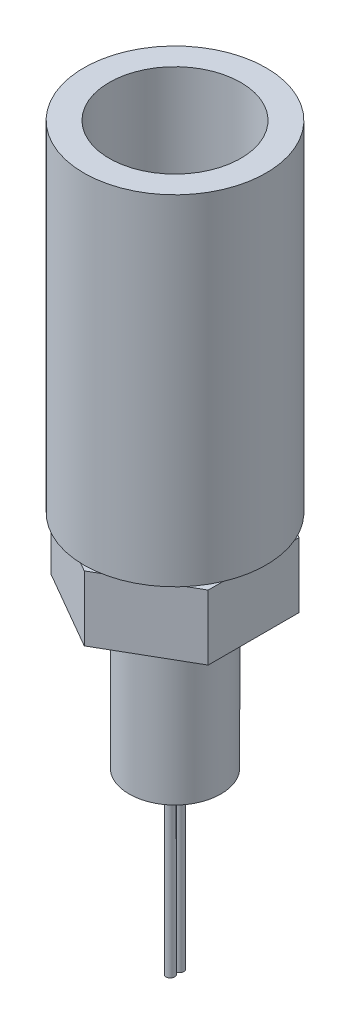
ISO-10303-21;
HEADER;
FILE_DESCRIPTION(('STEP AP214'),'2;1');
FILE_NAME('part.step','',(''),(''),'','','');
FILE_SCHEMA(('AUTOMOTIVE_DESIGN { 1 0 10303 214 1 1 1 1 }'));
ENDSEC;
DATA;
#1=APPLICATION_CONTEXT('core data for automotive mechanical design processes');
#2=APPLICATION_PROTOCOL_DEFINITION('international standard','automotive_design',2000,#1);
#3=PRODUCT_CONTEXT('',#1,'mechanical');
#4=PRODUCT('Part','Part','',(#3));
#5=PRODUCT_RELATED_PRODUCT_CATEGORY('part','',(#4));
#6=PRODUCT_DEFINITION_FORMATION('','',#4);
#7=PRODUCT_DEFINITION_CONTEXT('part definition',#1,'design');
#8=PRODUCT_DEFINITION('design','',#6,#7);
#9=PRODUCT_DEFINITION_SHAPE('','',#8);
#10=(LENGTH_UNIT() NAMED_UNIT(*) SI_UNIT(.MILLI.,.METRE.));
#11=(NAMED_UNIT(*) PLANE_ANGLE_UNIT() SI_UNIT($,.RADIAN.));
#12=(NAMED_UNIT(*) SI_UNIT($,.STERADIAN.) SOLID_ANGLE_UNIT());
#13=UNCERTAINTY_MEASURE_WITH_UNIT(LENGTH_MEASURE(1.E-05),#10,'distance_accuracy_value','');
#14=(GEOMETRIC_REPRESENTATION_CONTEXT(3) GLOBAL_UNCERTAINTY_ASSIGNED_CONTEXT((#13)) GLOBAL_UNIT_ASSIGNED_CONTEXT((#10,
#11,#12)) REPRESENTATION_CONTEXT('',''));
#15=CARTESIAN_POINT('',(0.,0.,0.));
#16=DIRECTION('',(0.,0.,1.));
#17=DIRECTION('',(1.,0.,0.));
#18=AXIS2_PLACEMENT_3D('',#15,#16,#17);
#19=CARTESIAN_POINT('',(0.,-18.280303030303,0.));
#20=DIRECTION('',(0.,-1.,0.));
#21=DIRECTION('',(0.,0.,-1.));
#22=AXIS2_PLACEMENT_3D('',#19,#20,#21);
#23=PLANE('',#22);
#24=CARTESIAN_POINT('',(0.,-18.280303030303,0.5588));
#25=DIRECTION('',(0.,-1.,0.));
#26=DIRECTION('',(0.,0.,-1.));
#27=AXIS2_PLACEMENT_3D('',#24,#25,#26);
#28=CIRCLE('',#27,0.5207);
#29=CARTESIAN_POINT('',(0.,-18.280303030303,0.0380999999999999));
#30=VERTEX_POINT('',#29);
#31=EDGE_CURVE('E366',#30,#30,#28,.T.);
#32=ORIENTED_EDGE('',*,*,#31,.F.);
#33=EDGE_LOOP('',(#32));
#34=FACE_BOUND('',#33,.T.);
#35=CARTESIAN_POINT('',(0.,-18.280303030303,0.));
#36=DIRECTION('',(0.,-1.,0.));
#37=DIRECTION('',(0.,0.,-1.));
#38=AXIS2_PLACEMENT_3D('',#35,#36,#37);
#39=CIRCLE('',#38,5.55625);
#40=CARTESIAN_POINT('',(0.,-18.280303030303,-5.55625));
#41=VERTEX_POINT('',#40);
#42=EDGE_CURVE('E326',#41,#41,#39,.T.);
#43=ORIENTED_EDGE('',*,*,#42,.T.);
#44=EDGE_LOOP('',(#43));
#45=FACE_BOUND('',#44,.T.);
#46=CARTESIAN_POINT('',(0.,-18.280303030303,-0.5588));
#47=DIRECTION('',(0.,-1.,0.));
#48=DIRECTION('',(0.,0.,-1.));
#49=AXIS2_PLACEMENT_3D('',#46,#47,#48);
#50=CIRCLE('',#49,0.5207);
#51=CARTESIAN_POINT('',(0.,-18.280303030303,-1.0795));
#52=VERTEX_POINT('',#51);
#53=EDGE_CURVE('E372',#52,#52,#50,.T.);
#54=ORIENTED_EDGE('',*,*,#53,.F.);
#55=EDGE_LOOP('',(#54));
#56=FACE_BOUND('',#55,.T.);
#57=ADVANCED_FACE('F34',(#34,#45,#56),#23,.T.);
#58=CARTESIAN_POINT('',(8.8011,17.272,0.));
#59=DIRECTION('',(0.,-1.,0.));
#60=DIRECTION('',(1.,0.,0.));
#61=AXIS2_PLACEMENT_3D('',#58,#59,#60);
#62=PLANE('',#61);
#63=CARTESIAN_POINT('',(0.,17.272,0.));
#64=DIRECTION('',(0.,1.,0.));
#65=DIRECTION('',(-1.,0.,0.));
#66=AXIS2_PLACEMENT_3D('',#63,#64,#65);
#67=CIRCLE('',#66,8.8011);
#68=CARTESIAN_POINT('',(-8.8011,17.272,0.));
#69=VERTEX_POINT('',#68);
#70=EDGE_CURVE('E125',#69,#69,#67,.T.);
#71=ORIENTED_EDGE('',*,*,#70,.T.);
#72=EDGE_LOOP('',(#71));
#73=FACE_BOUND('',#72,.T.);
#74=CARTESIAN_POINT('',(0.,17.272,0.));
#75=DIRECTION('',(0.,-1.,0.));
#76=DIRECTION('',(1.,0.,0.));
#77=AXIS2_PLACEMENT_3D('',#74,#75,#76);
#78=CIRCLE('',#77,7.875);
#79=CARTESIAN_POINT('',(7.875,17.272,0.));
#80=VERTEX_POINT('',#79);
#81=EDGE_CURVE('E141',#80,#80,#78,.F.);
#82=ORIENTED_EDGE('',*,*,#81,.F.);
#83=EDGE_LOOP('',(#82));
#84=FACE_BOUND('',#83,.T.);
#85=ADVANCED_FACE('F174',(#73,#84),#62,.F.);
#86=CARTESIAN_POINT('',(0.,0.,0.));
#87=DIRECTION('',(0.,1.,0.));
#88=DIRECTION('',(-1.,0.,0.));
#89=AXIS2_PLACEMENT_3D('',#86,#87,#88);
#90=CYLINDRICAL_SURFACE('',#89,8.8011);
#91=ORIENTED_EDGE('',*,*,#70,.F.);
#92=EDGE_LOOP('',(#91));
#93=FACE_BOUND('',#92,.T.);
#94=CARTESIAN_POINT('',(0.,16.4592,0.));
#95=DIRECTION('',(0.,1.,0.));
#96=DIRECTION('',(-1.,0.,0.));
#97=AXIS2_PLACEMENT_3D('',#94,#95,#96);
#98=CIRCLE('',#97,8.8011);
#99=CARTESIAN_POINT('',(-8.8011,16.4592,0.));
#100=VERTEX_POINT('',#99);
#101=EDGE_CURVE('E278',#100,#100,#98,.T.);
#102=ORIENTED_EDGE('',*,*,#101,.T.);
#103=EDGE_LOOP('',(#102));
#104=FACE_BOUND('',#103,.T.);
#105=ADVANCED_FACE('F182',(#93,#104),#90,.T.);
#106=CARTESIAN_POINT('',(9.398,16.4592,0.));
#107=DIRECTION('',(0.,-1.,0.));
#108=DIRECTION('',(1.,0.,0.));
#109=AXIS2_PLACEMENT_3D('',#106,#107,#108);
#110=PLANE('',#109);
#111=ORIENTED_EDGE('',*,*,#101,.F.);
#112=EDGE_LOOP('',(#111));
#113=FACE_BOUND('',#112,.T.);
#114=CARTESIAN_POINT('',(0.,16.4592,0.));
#115=DIRECTION('',(0.,1.,0.));
#116=DIRECTION('',(-1.,0.,0.));
#117=AXIS2_PLACEMENT_3D('',#114,#115,#116);
#118=CIRCLE('',#117,9.398);
#119=CARTESIAN_POINT('',(-9.398,16.4592,0.));
#120=VERTEX_POINT('',#119);
#121=EDGE_CURVE('E281',#120,#120,#118,.T.);
#122=ORIENTED_EDGE('',*,*,#121,.T.);
#123=EDGE_LOOP('',(#122));
#124=FACE_BOUND('',#123,.T.);
#125=ADVANCED_FACE('F250',(#113,#124),#110,.F.);
#126=CARTESIAN_POINT('',(0.,0.,0.));
#127=DIRECTION('',(0.,1.,0.));
#128=DIRECTION('',(-1.,0.,0.));
#129=AXIS2_PLACEMENT_3D('',#126,#127,#128);
#130=CYLINDRICAL_SURFACE('',#129,9.398);
#131=ORIENTED_EDGE('',*,*,#121,.F.);
#132=EDGE_LOOP('',(#131));
#133=FACE_BOUND('',#132,.T.);
#134=CARTESIAN_POINT('',(0.,14.8844,0.));
#135=DIRECTION('',(0.,1.,0.));
#136=DIRECTION('',(-1.,0.,0.));
#137=AXIS2_PLACEMENT_3D('',#134,#135,#136);
#138=CIRCLE('',#137,9.398);
#139=CARTESIAN_POINT('',(-9.398,14.8844,0.));
#140=VERTEX_POINT('',#139);
#141=EDGE_CURVE('E284',#140,#140,#138,.T.);
#142=ORIENTED_EDGE('',*,*,#141,.T.);
#143=EDGE_LOOP('',(#142));
#144=FACE_BOUND('',#143,.T.);
#145=ADVANCED_FACE('F246',(#133,#144),#130,.T.);
#146=CARTESIAN_POINT('',(8.8011,14.8844,0.));
#147=DIRECTION('',(0.,1.,0.));
#148=DIRECTION('',(-1.,0.,0.));
#149=AXIS2_PLACEMENT_3D('',#146,#147,#148);
#150=PLANE('',#149);
#151=ORIENTED_EDGE('',*,*,#141,.F.);
#152=EDGE_LOOP('',(#151));
#153=FACE_BOUND('',#152,.T.);
#154=CARTESIAN_POINT('',(0.,14.8844,0.));
#155=DIRECTION('',(0.,1.,0.));
#156=DIRECTION('',(-1.,0.,0.));
#157=AXIS2_PLACEMENT_3D('',#154,#155,#156);
#158=CIRCLE('',#157,8.8011);
#159=CARTESIAN_POINT('',(-8.8011,14.8844,0.));
#160=VERTEX_POINT('',#159);
#161=EDGE_CURVE('E287',#160,#160,#158,.T.);
#162=ORIENTED_EDGE('',*,*,#161,.T.);
#163=EDGE_LOOP('',(#162));
#164=FACE_BOUND('',#163,.T.);
#165=ADVANCED_FACE('F242',(#153,#164),#150,.F.);
#166=CARTESIAN_POINT('',(0.,0.,0.));
#167=DIRECTION('',(0.,1.,0.));
#168=DIRECTION('',(-1.,0.,0.));
#169=AXIS2_PLACEMENT_3D('',#166,#167,#168);
#170=CYLINDRICAL_SURFACE('',#169,8.8011);
#171=ORIENTED_EDGE('',*,*,#161,.F.);
#172=EDGE_LOOP('',(#171));
#173=FACE_BOUND('',#172,.T.);
#174=CARTESIAN_POINT('',(0.,13.2334,0.));
#175=DIRECTION('',(0.,1.,0.));
#176=DIRECTION('',(-1.,0.,0.));
#177=AXIS2_PLACEMENT_3D('',#174,#175,#176);
#178=CIRCLE('',#177,8.8011);
#179=CARTESIAN_POINT('',(-8.8011,13.2334,0.));
#180=VERTEX_POINT('',#179);
#181=EDGE_CURVE('E290',#180,#180,#178,.T.);
#182=ORIENTED_EDGE('',*,*,#181,.T.);
#183=EDGE_LOOP('',(#182));
#184=FACE_BOUND('',#183,.T.);
#185=ADVANCED_FACE('F238',(#173,#184),#170,.T.);
#186=CARTESIAN_POINT('',(9.398,13.2334,0.));
#187=DIRECTION('',(0.,-1.,0.));
#188=DIRECTION('',(1.,0.,0.));
#189=AXIS2_PLACEMENT_3D('',#186,#187,#188);
#190=PLANE('',#189);
#191=CARTESIAN_POINT('',(0.,13.2334,0.));
#192=DIRECTION('',(0.,-1.,0.));
#193=DIRECTION('',(0.,0.,-1.));
#194=AXIS2_PLACEMENT_3D('',#191,#192,#193);
#195=CIRCLE('',#194,9.0805);
#196=CARTESIAN_POINT('',(0.,13.2334,-9.0805));
#197=VERTEX_POINT('',#196);
#198=EDGE_CURVE('E350',#197,#197,#195,.T.);
#199=ORIENTED_EDGE('',*,*,#198,.F.);
#200=EDGE_LOOP('',(#199));
#201=FACE_BOUND('',#200,.T.);
#202=ORIENTED_EDGE('',*,*,#181,.F.);
#203=EDGE_LOOP('',(#202));
#204=FACE_BOUND('',#203,.T.);
#205=ADVANCED_FACE('F221',(#201,#204),#190,.F.);
#206=CARTESIAN_POINT('',(0.,27.682,0.));
#207=DIRECTION('',(0.,-1.,0.));
#208=DIRECTION('',(1.,0.,0.));
#209=AXIS2_PLACEMENT_3D('',#206,#207,#208);
#210=CYLINDRICAL_SURFACE('',#209,7.875);
#211=CARTESIAN_POINT('',(0.,27.682,0.));
#212=DIRECTION('',(0.,1.,0.));
#213=DIRECTION('',(-1.,0.,0.));
#214=AXIS2_PLACEMENT_3D('',#211,#212,#213);
#215=CIRCLE('',#214,7.875);
#216=CARTESIAN_POINT('',(-7.875,27.682,0.));
#217=VERTEX_POINT('',#216);
#218=EDGE_CURVE('E305',#217,#217,#215,.T.);
#219=ORIENTED_EDGE('',*,*,#218,.F.);
#220=EDGE_LOOP('',(#219));
#221=FACE_BOUND('',#220,.T.);
#222=ORIENTED_EDGE('',*,*,#81,.T.);
#223=EDGE_LOOP('',(#222));
#224=FACE_BOUND('',#223,.T.);
#225=ADVANCED_FACE('F217',(#221,#224),#210,.T.);
#226=CARTESIAN_POINT('',(0.,27.682,0.));
#227=DIRECTION('',(0.,1.,0.));
#228=DIRECTION('',(-1.,0.,0.));
#229=AXIS2_PLACEMENT_3D('',#226,#227,#228);
#230=PLANE('',#229);
#231=CARTESIAN_POINT('',(0.,27.682,-5.1308));
#232=DIRECTION('',(0.,1.,0.));
#233=DIRECTION('',(-1.,0.,0.));
#234=AXIS2_PLACEMENT_3D('',#231,#232,#233);
#235=CIRCLE('',#234,0.762);
#236=CARTESIAN_POINT('',(-0.762000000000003,27.682,-5.1308));
#237=VERTEX_POINT('',#236);
#238=EDGE_CURVE('E323',#237,#237,#235,.T.);
#239=ORIENTED_EDGE('',*,*,#238,.F.);
#240=EDGE_LOOP('',(#239));
#241=FACE_BOUND('',#240,.T.);
#242=CARTESIAN_POINT('',(-4.318,27.682,0.));
#243=DIRECTION('',(0.,1.,0.));
#244=DIRECTION('',(-1.,0.,0.));
#245=AXIS2_PLACEMENT_3D('',#242,#243,#244);
#246=CIRCLE('',#245,0.955);
#247=CARTESIAN_POINT('',(-5.273,27.682,0.));
#248=VERTEX_POINT('',#247);
#249=EDGE_CURVE('E317',#248,#248,#246,.T.);
#250=ORIENTED_EDGE('',*,*,#249,.F.);
#251=EDGE_LOOP('',(#250));
#252=FACE_BOUND('',#251,.T.);
#253=CARTESIAN_POINT('',(4.318,27.682,0.));
#254=DIRECTION('',(0.,1.,0.));
#255=DIRECTION('',(-1.,0.,0.));
#256=AXIS2_PLACEMENT_3D('',#253,#254,#255);
#257=CIRCLE('',#256,0.955);
#258=CARTESIAN_POINT('',(3.363,27.682,0.));
#259=VERTEX_POINT('',#258);
#260=EDGE_CURVE('E311',#259,#259,#257,.T.);
#261=ORIENTED_EDGE('',*,*,#260,.F.);
#262=EDGE_LOOP('',(#261));
#263=FACE_BOUND('',#262,.T.);
#264=ORIENTED_EDGE('',*,*,#218,.T.);
#265=EDGE_LOOP('',(#264));
#266=FACE_BOUND('',#265,.T.);
#267=ADVANCED_FACE('F213',(#241,#252,#263,#266),#230,.T.);
#268=CARTESIAN_POINT('',(8.8011,17.272,0.));
#269=DIRECTION('',(0.,-1.,0.));
#270=DIRECTION('',(1.,0.,0.));
#271=AXIS2_PLACEMENT_3D('',#268,#269,#270);
#272=PLANE('',#271);
#273=CARTESIAN_POINT('',(4.318,17.272,0.));
#274=DIRECTION('',(0.,-1.,0.));
#275=DIRECTION('',(1.,0.,0.));
#276=AXIS2_PLACEMENT_3D('',#273,#274,#275);
#277=CIRCLE('',#276,0.955);
#278=CARTESIAN_POINT('',(5.273,17.272,0.));
#279=VERTEX_POINT('',#278);
#280=EDGE_CURVE('E308',#279,#279,#277,.F.);
#281=ORIENTED_EDGE('',*,*,#280,.T.);
#282=EDGE_LOOP('',(#281));
#283=FACE_BOUND('',#282,.T.);
#284=ADVANCED_FACE('F209',(#283),#272,.F.);
#285=CARTESIAN_POINT('',(4.318,14.5708520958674,0.));
#286=DIRECTION('',(0.,1.,0.));
#287=DIRECTION('',(-1.,0.,0.));
#288=AXIS2_PLACEMENT_3D('',#285,#286,#287);
#289=CYLINDRICAL_SURFACE('',#288,0.955);
#290=ORIENTED_EDGE('',*,*,#260,.T.);
#291=EDGE_LOOP('',(#290));
#292=FACE_BOUND('',#291,.T.);
#293=ORIENTED_EDGE('',*,*,#280,.F.);
#294=EDGE_LOOP('',(#293));
#295=FACE_BOUND('',#294,.T.);
#296=ADVANCED_FACE('F205',(#292,#295),#289,.F.);
#297=CARTESIAN_POINT('',(8.8011,17.272,0.));
#298=DIRECTION('',(0.,-1.,0.));
#299=DIRECTION('',(1.,0.,0.));
#300=AXIS2_PLACEMENT_3D('',#297,#298,#299);
#301=PLANE('',#300);
#302=CARTESIAN_POINT('',(-4.318,17.272,0.));
#303=DIRECTION('',(0.,-1.,0.));
#304=DIRECTION('',(1.,0.,0.));
#305=AXIS2_PLACEMENT_3D('',#302,#303,#304);
#306=CIRCLE('',#305,0.955);
#307=CARTESIAN_POINT('',(-3.363,17.272,0.));
#308=VERTEX_POINT('',#307);
#309=EDGE_CURVE('E314',#308,#308,#306,.F.);
#310=ORIENTED_EDGE('',*,*,#309,.T.);
#311=EDGE_LOOP('',(#310));
#312=FACE_BOUND('',#311,.T.);
#313=ADVANCED_FACE('F201',(#312),#301,.F.);
#314=CARTESIAN_POINT('',(-4.318,14.5708520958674,0.));
#315=DIRECTION('',(0.,1.,0.));
#316=DIRECTION('',(-1.,0.,0.));
#317=AXIS2_PLACEMENT_3D('',#314,#315,#316);
#318=CYLINDRICAL_SURFACE('',#317,0.955);
#319=ORIENTED_EDGE('',*,*,#249,.T.);
#320=EDGE_LOOP('',(#319));
#321=FACE_BOUND('',#320,.T.);
#322=ORIENTED_EDGE('',*,*,#309,.F.);
#323=EDGE_LOOP('',(#322));
#324=FACE_BOUND('',#323,.T.);
#325=ADVANCED_FACE('F197',(#321,#324),#318,.F.);
#326=CARTESIAN_POINT('',(8.8011,17.272,0.));
#327=DIRECTION('',(0.,-1.,0.));
#328=DIRECTION('',(1.,0.,0.));
#329=AXIS2_PLACEMENT_3D('',#326,#327,#328);
#330=PLANE('',#329);
#331=CARTESIAN_POINT('',(0.,17.272,-5.1308));
#332=DIRECTION('',(0.,-1.,0.));
#333=DIRECTION('',(1.,0.,0.));
#334=AXIS2_PLACEMENT_3D('',#331,#332,#333);
#335=CIRCLE('',#334,0.762);
#336=CARTESIAN_POINT('',(0.761999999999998,17.272,-5.1308));
#337=VERTEX_POINT('',#336);
#338=EDGE_CURVE('E320',#337,#337,#335,.F.);
#339=ORIENTED_EDGE('',*,*,#338,.T.);
#340=EDGE_LOOP('',(#339));
#341=FACE_BOUND('',#340,.T.);
#342=ADVANCED_FACE('F193',(#341),#330,.F.);
#343=CARTESIAN_POINT('',(0.,15.1167385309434,-5.1308));
#344=DIRECTION('',(0.,1.,0.));
#345=DIRECTION('',(-1.,0.,0.));
#346=AXIS2_PLACEMENT_3D('',#343,#344,#345);
#347=CYLINDRICAL_SURFACE('',#346,0.762);
#348=ORIENTED_EDGE('',*,*,#238,.T.);
#349=EDGE_LOOP('',(#348));
#350=FACE_BOUND('',#349,.T.);
#351=ORIENTED_EDGE('',*,*,#338,.F.);
#352=EDGE_LOOP('',(#351));
#353=FACE_BOUND('',#352,.T.);
#354=ADVANCED_FACE('F189',(#350,#353),#347,.F.);
#355=CARTESIAN_POINT('',(9.94448184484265,13.2334,0.));
#356=DIRECTION('',(0.,-1.,0.));
#357=DIRECTION('',(0.,0.,-1.));
#358=AXIS2_PLACEMENT_3D('',#355,#356,#357);
#359=PLANE('',#358);
#360=CARTESIAN_POINT('',(0.,13.2334,0.));
#361=DIRECTION('',(0.,-1.,0.));
#362=DIRECTION('',(0.,0.,-1.));
#363=AXIS2_PLACEMENT_3D('',#360,#361,#362);
#364=CIRCLE('',#363,9.94448184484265);
#365=CARTESIAN_POINT('',(0.,13.2334,-9.94448184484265));
#366=VERTEX_POINT('',#365);
#367=EDGE_CURVE('E353',#366,#366,#364,.T.);
#368=ORIENTED_EDGE('',*,*,#367,.T.);
#369=EDGE_LOOP('',(#368));
#370=FACE_BOUND('',#369,.T.);
#371=CARTESIAN_POINT('',(0.,13.2334,0.));
#372=DIRECTION('',(0.,1.,0.));
#373=DIRECTION('',(-1.,0.,0.));
#374=AXIS2_PLACEMENT_3D('',#371,#372,#373);
#375=CIRCLE('',#374,9.398);
#376=CARTESIAN_POINT('',(-9.398,13.2334,0.));
#377=VERTEX_POINT('',#376);
#378=EDGE_CURVE('E293',#377,#377,#375,.T.);
#379=ORIENTED_EDGE('',*,*,#378,.T.);
#380=EDGE_LOOP('',(#379));
#381=FACE_BOUND('',#380,.T.);
#382=ADVANCED_FACE('F192',(#370,#381),#359,.T.);
#383=CARTESIAN_POINT('',(9.0805,8.511893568,0.));
#384=DIRECTION('',(0.,-1.,0.));
#385=DIRECTION('',(0.,0.,-1.));
#386=AXIS2_PLACEMENT_3D('',#383,#384,#385);
#387=PLANE('',#386);
#388=CARTESIAN_POINT('',(0.,8.511893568,0.));
#389=DIRECTION('',(0.,-1.,0.));
#390=DIRECTION('',(0.,0.,-1.));
#391=AXIS2_PLACEMENT_3D('',#388,#389,#390);
#392=CIRCLE('',#391,11.049);
#393=CARTESIAN_POINT('',(0.,8.511893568,-11.049));
#394=VERTEX_POINT('',#393);
#395=EDGE_CURVE('E329',#394,#394,#392,.T.);
#396=ORIENTED_EDGE('',*,*,#395,.T.);
#397=EDGE_LOOP('',(#396));
#398=FACE_BOUND('',#397,.T.);
#399=CARTESIAN_POINT('',(0.,8.511893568,0.));
#400=DIRECTION('',(0.,-1.,0.));
#401=DIRECTION('',(0.,0.,-1.));
#402=AXIS2_PLACEMENT_3D('',#399,#400,#401);
#403=CIRCLE('',#402,9.0805);
#404=CARTESIAN_POINT('',(0.,8.511893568,-9.0805));
#405=VERTEX_POINT('',#404);
#406=EDGE_CURVE('E362',#405,#405,#403,.T.);
#407=ORIENTED_EDGE('',*,*,#406,.F.);
#408=EDGE_LOOP('',(#407));
#409=FACE_BOUND('',#408,.T.);
#410=ADVANCED_FACE('F412',(#398,#409),#387,.T.);
#411=CARTESIAN_POINT('',(0.,0.,0.));
#412=DIRECTION('',(0.,-1.,0.));
#413=DIRECTION('',(0.,0.,-1.));
#414=AXIS2_PLACEMENT_3D('',#411,#412,#413);
#415=CYLINDRICAL_SURFACE('',#414,11.049);
#416=CARTESIAN_POINT('',(0.,49.659893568,0.));
#417=DIRECTION('',(0.,-1.,0.));
#418=DIRECTION('',(0.,0.,-1.));
#419=AXIS2_PLACEMENT_3D('',#416,#417,#418);
#420=CIRCLE('',#419,11.049);
#421=CARTESIAN_POINT('',(0.,49.659893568,-11.049));
#422=VERTEX_POINT('',#421);
#423=EDGE_CURVE('E332',#422,#422,#420,.T.);
#424=ORIENTED_EDGE('',*,*,#423,.T.);
#425=EDGE_LOOP('',(#424));
#426=FACE_BOUND('',#425,.T.);
#427=ORIENTED_EDGE('',*,*,#395,.F.);
#428=EDGE_LOOP('',(#427));
#429=FACE_BOUND('',#428,.T.);
#430=ADVANCED_FACE('F436',(#426,#429),#415,.T.);
#431=CARTESIAN_POINT('',(11.049,49.659893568,0.));
#432=DIRECTION('',(0.,1.,0.));
#433=DIRECTION('',(0.,0.,1.));
#434=AXIS2_PLACEMENT_3D('',#431,#432,#433);
#435=PLANE('',#434);
#436=CARTESIAN_POINT('',(0.,49.659893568,0.));
#437=DIRECTION('',(0.,-1.,0.));
#438=DIRECTION('',(0.,0.,-1.));
#439=AXIS2_PLACEMENT_3D('',#436,#437,#438);
#440=CIRCLE('',#439,7.9756);
#441=CARTESIAN_POINT('',(0.,49.659893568,-7.9756));
#442=VERTEX_POINT('',#441);
#443=EDGE_CURVE('E335',#442,#442,#440,.T.);
#444=ORIENTED_EDGE('',*,*,#443,.T.);
#445=EDGE_LOOP('',(#444));
#446=FACE_BOUND('',#445,.T.);
#447=ORIENTED_EDGE('',*,*,#423,.F.);
#448=EDGE_LOOP('',(#447));
#449=FACE_BOUND('',#448,.T.);
#450=ADVANCED_FACE('F432',(#446,#449),#435,.T.);
#451=CARTESIAN_POINT('',(0.,0.,0.));
#452=DIRECTION('',(0.,-1.,0.));
#453=DIRECTION('',(0.,0.,-1.));
#454=AXIS2_PLACEMENT_3D('',#451,#452,#453);
#455=CYLINDRICAL_SURFACE('',#454,7.9756);
#456=CARTESIAN_POINT('',(0.,19.0036213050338,0.));
#457=DIRECTION('',(0.,-1.,0.));
#458=DIRECTION('',(0.,0.,-1.));
#459=AXIS2_PLACEMENT_3D('',#456,#457,#458);
#460=CIRCLE('',#459,7.9756);
#461=CARTESIAN_POINT('',(0.,19.0036213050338,-7.9756));
#462=VERTEX_POINT('',#461);
#463=EDGE_CURVE('E338',#462,#462,#460,.T.);
#464=ORIENTED_EDGE('',*,*,#463,.T.);
#465=EDGE_LOOP('',(#464));
#466=FACE_BOUND('',#465,.T.);
#467=ORIENTED_EDGE('',*,*,#443,.F.);
#468=EDGE_LOOP('',(#467));
#469=FACE_BOUND('',#468,.T.);
#470=ADVANCED_FACE('F428',(#466,#469),#455,.F.);
#471=CARTESIAN_POINT('',(9.94448184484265,19.0036213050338,0.));
#472=DIRECTION('',(0.,-1.,0.));
#473=DIRECTION('',(0.,0.,-1.));
#474=AXIS2_PLACEMENT_3D('',#471,#472,#473);
#475=PLANE('',#474);
#476=CARTESIAN_POINT('',(0.,19.0036213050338,0.));
#477=DIRECTION('',(0.,-1.,0.));
#478=DIRECTION('',(0.,0.,-1.));
#479=AXIS2_PLACEMENT_3D('',#476,#477,#478);
#480=CIRCLE('',#479,9.94448184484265);
#481=CARTESIAN_POINT('',(0.,19.0036213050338,-9.94448184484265));
#482=VERTEX_POINT('',#481);
#483=EDGE_CURVE('E341',#482,#482,#480,.T.);
#484=ORIENTED_EDGE('',*,*,#483,.T.);
#485=EDGE_LOOP('',(#484));
#486=FACE_BOUND('',#485,.T.);
#487=ORIENTED_EDGE('',*,*,#463,.F.);
#488=EDGE_LOOP('',(#487));
#489=FACE_BOUND('',#488,.T.);
#490=ADVANCED_FACE('F424',(#486,#489),#475,.T.);
#491=CARTESIAN_POINT('',(0.,0.,0.));
#492=DIRECTION('',(0.,-1.,0.));
#493=DIRECTION('',(0.,0.,-1.));
#494=AXIS2_PLACEMENT_3D('',#491,#492,#493);
#495=CYLINDRICAL_SURFACE('',#494,9.94448184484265);
#496=CARTESIAN_POINT('',(0.,14.7574,0.));
#497=DIRECTION('',(0.,-1.,0.));
#498=DIRECTION('',(0.,0.,-1.));
#499=AXIS2_PLACEMENT_3D('',#496,#497,#498);
#500=CIRCLE('',#499,9.94448184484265);
#501=CARTESIAN_POINT('',(0.,14.7574,-9.94448184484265));
#502=VERTEX_POINT('',#501);
#503=EDGE_CURVE('E344',#502,#502,#500,.T.);
#504=ORIENTED_EDGE('',*,*,#503,.T.);
#505=EDGE_LOOP('',(#504));
#506=FACE_BOUND('',#505,.T.);
#507=ORIENTED_EDGE('',*,*,#483,.F.);
#508=EDGE_LOOP('',(#507));
#509=FACE_BOUND('',#508,.T.);
#510=ADVANCED_FACE('F420',(#506,#509),#495,.F.);
#511=CARTESIAN_POINT('',(9.0805,14.7574,0.));
#512=DIRECTION('',(0.,1.,0.));
#513=DIRECTION('',(0.,0.,1.));
#514=AXIS2_PLACEMENT_3D('',#511,#512,#513);
#515=PLANE('',#514);
#516=CARTESIAN_POINT('',(0.,14.7574,0.));
#517=DIRECTION('',(0.,-1.,0.));
#518=DIRECTION('',(0.,0.,-1.));
#519=AXIS2_PLACEMENT_3D('',#516,#517,#518);
#520=CIRCLE('',#519,9.0805);
#521=CARTESIAN_POINT('',(0.,14.7574,-9.0805));
#522=VERTEX_POINT('',#521);
#523=EDGE_CURVE('E347',#522,#522,#520,.T.);
#524=ORIENTED_EDGE('',*,*,#523,.T.);
#525=EDGE_LOOP('',(#524));
#526=FACE_BOUND('',#525,.T.);
#527=ORIENTED_EDGE('',*,*,#503,.F.);
#528=EDGE_LOOP('',(#527));
#529=FACE_BOUND('',#528,.T.);
#530=ADVANCED_FACE('F416',(#526,#529),#515,.T.);
#531=CARTESIAN_POINT('',(0.,0.,0.));
#532=DIRECTION('',(0.,-1.,0.));
#533=DIRECTION('',(0.,0.,-1.));
#534=AXIS2_PLACEMENT_3D('',#531,#532,#533);
#535=CYLINDRICAL_SURFACE('',#534,9.0805);
#536=ORIENTED_EDGE('',*,*,#198,.T.);
#537=EDGE_LOOP('',(#536));
#538=FACE_BOUND('',#537,.T.);
#539=ORIENTED_EDGE('',*,*,#523,.F.);
#540=EDGE_LOOP('',(#539));
#541=FACE_BOUND('',#540,.T.);
#542=ADVANCED_FACE('F408',(#538,#541),#535,.F.);
#543=CARTESIAN_POINT('',(0.,0.,0.));
#544=DIRECTION('',(0.,-1.,0.));
#545=DIRECTION('',(0.,0.,-1.));
#546=AXIS2_PLACEMENT_3D('',#543,#544,#545);
#547=CYLINDRICAL_SURFACE('',#546,9.94448184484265);
#548=CARTESIAN_POINT('',(0.,11.5824,0.));
#549=DIRECTION('',(0.,-1.,0.));
#550=DIRECTION('',(0.,0.,-1.));
#551=AXIS2_PLACEMENT_3D('',#548,#549,#550);
#552=CIRCLE('',#551,9.94448184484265);
#553=CARTESIAN_POINT('',(0.,11.5824,-9.94448184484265));
#554=VERTEX_POINT('',#553);
#555=EDGE_CURVE('E356',#554,#554,#552,.T.);
#556=ORIENTED_EDGE('',*,*,#555,.T.);
#557=EDGE_LOOP('',(#556));
#558=FACE_BOUND('',#557,.T.);
#559=ORIENTED_EDGE('',*,*,#367,.F.);
#560=EDGE_LOOP('',(#559));
#561=FACE_BOUND('',#560,.T.);
#562=ADVANCED_FACE('F404',(#558,#561),#547,.F.);
#563=CARTESIAN_POINT('',(9.0805,11.5824,0.));
#564=DIRECTION('',(0.,1.,0.));
#565=DIRECTION('',(0.,0.,1.));
#566=AXIS2_PLACEMENT_3D('',#563,#564,#565);
#567=PLANE('',#566);
#568=CARTESIAN_POINT('',(0.,11.5824,0.));
#569=DIRECTION('',(0.,-1.,0.));
#570=DIRECTION('',(0.,0.,-1.));
#571=AXIS2_PLACEMENT_3D('',#568,#569,#570);
#572=CIRCLE('',#571,9.0805);
#573=CARTESIAN_POINT('',(0.,11.5824,-9.0805));
#574=VERTEX_POINT('',#573);
#575=EDGE_CURVE('E359',#574,#574,#572,.T.);
#576=ORIENTED_EDGE('',*,*,#575,.T.);
#577=EDGE_LOOP('',(#576));
#578=FACE_BOUND('',#577,.T.);
#579=ORIENTED_EDGE('',*,*,#555,.F.);
#580=EDGE_LOOP('',(#579));
#581=FACE_BOUND('',#580,.T.);
#582=ADVANCED_FACE('F400',(#578,#581),#567,.T.);
#583=CARTESIAN_POINT('',(0.,0.,0.));
#584=DIRECTION('',(0.,-1.,0.));
#585=DIRECTION('',(0.,0.,-1.));
#586=AXIS2_PLACEMENT_3D('',#583,#584,#585);
#587=CYLINDRICAL_SURFACE('',#586,9.0805);
#588=ORIENTED_EDGE('',*,*,#406,.T.);
#589=EDGE_LOOP('',(#588));
#590=FACE_BOUND('',#589,.T.);
#591=ORIENTED_EDGE('',*,*,#575,.F.);
#592=EDGE_LOOP('',(#591));
#593=FACE_BOUND('',#592,.T.);
#594=ADVANCED_FACE('F164',(#590,#593),#587,.F.);
#595=CARTESIAN_POINT('',(0.,-18.280303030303,0.));
#596=DIRECTION('',(0.,1.,0.));
#597=DIRECTION('',(0.,0.,1.));
#598=AXIS2_PLACEMENT_3D('',#595,#596,#597);
#599=CYLINDRICAL_SURFACE('',#598,5.55625);
#600=ORIENTED_EDGE('',*,*,#42,.F.);
#601=EDGE_LOOP('',(#600));
#602=FACE_BOUND('',#601,.T.);
#603=CARTESIAN_POINT('',(0.,0.,0.));
#604=DIRECTION('',(0.,1.,0.));
#605=DIRECTION('',(0.,0.,1.));
#606=AXIS2_PLACEMENT_3D('',#603,#604,#605);
#607=CIRCLE('',#606,5.55625);
#608=CARTESIAN_POINT('',(0.,0.,5.55625));
#609=VERTEX_POINT('',#608);
#610=EDGE_CURVE('E144',#609,#609,#607,.F.);
#611=ORIENTED_EDGE('',*,*,#610,.T.);
#612=EDGE_LOOP('',(#611));
#613=FACE_BOUND('',#612,.T.);
#614=ADVANCED_FACE('F154',(#602,#613),#599,.T.);
#615=CARTESIAN_POINT('',(-9.52499999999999,0.,-16.4977839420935));
#616=DIRECTION('',(0.,1.,0.));
#617=DIRECTION('',(0.,0.,1.));
#618=AXIS2_PLACEMENT_3D('',#615,#616,#617);
#619=PLANE('',#618);
#620=ORIENTED_EDGE('',*,*,#610,.F.);
#621=EDGE_LOOP('',(#620));
#622=FACE_BOUND('',#621,.T.);
#623=CARTESIAN_POINT('',(0.,0.,0.));
#624=DIRECTION('',(0.,-1.,0.));
#625=DIRECTION('',(0.,0.,-1.));
#626=AXIS2_PLACEMENT_3D('',#623,#624,#625);
#627=CIRCLE('',#626,6.25663579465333);
#628=CARTESIAN_POINT('',(0.,0.,-6.25663579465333));
#629=VERTEX_POINT('',#628);
#630=EDGE_CURVE('E43',#629,#629,#627,.F.);
#631=ORIENTED_EDGE('',*,*,#630,.F.);
#632=EDGE_LOOP('',(#631));
#633=FACE_BOUND('',#632,.T.);
#634=ADVANCED_FACE('F152',(#622,#633),#619,.F.);
#635=CARTESIAN_POINT('',(0.,0.284318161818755,0.));
#636=DIRECTION('',(0.,1.,0.));
#637=DIRECTION('',(-1.,0.,0.));
#638=AXIS2_PLACEMENT_3D('',#635,#636,#637);
#639=TOROIDAL_SURFACE('',#638,7.1,0.89);
#640=ORIENTED_EDGE('',*,*,#630,.T.);
#641=EDGE_LOOP('',(#640));
#642=FACE_BOUND('',#641,.T.);
#643=CARTESIAN_POINT('',(0.,0.,0.));
#644=DIRECTION('',(0.,1.,0.));
#645=DIRECTION('',(0.,0.,1.));
#646=AXIS2_PLACEMENT_3D('',#643,#644,#645);
#647=CIRCLE('',#646,7.94336420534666);
#648=CARTESIAN_POINT('',(0.,0.,7.94336420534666));
#649=VERTEX_POINT('',#648);
#650=EDGE_CURVE('E11',#649,#649,#647,.F.);
#651=ORIENTED_EDGE('',*,*,#650,.T.);
#652=EDGE_LOOP('',(#651));
#653=FACE_BOUND('',#652,.T.);
#654=ADVANCED_FACE('F149',(#642,#653),#639,.T.);
#655=DIRECTION('',(-0.866025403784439,0.,-0.5));
#656=VECTOR('',#655,1.);
#657=CARTESIAN_POINT('',(9.52499999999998,0.,-5.4992613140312));
#658=LINE('',#657,#656);
#659=CARTESIAN_POINT('',(9.52499999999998,0.,-5.4992613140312));
#660=VERTEX_POINT('',#659);
#661=CARTESIAN_POINT('',(0.,0.,-10.9985226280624));
#662=VERTEX_POINT('',#661);
#663=EDGE_CURVE('E121',#660,#662,#658,.T.);
#664=ORIENTED_EDGE('',*,*,#663,.F.);
#665=DIRECTION('',(0.,0.,-1.));
#666=VECTOR('',#665,1.);
#667=CARTESIAN_POINT('',(9.52499999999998,0.,5.49926131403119));
#668=LINE('',#667,#666);
#669=CARTESIAN_POINT('',(9.52499999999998,0.,5.49926131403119));
#670=VERTEX_POINT('',#669);
#671=EDGE_CURVE('E80',#670,#660,#668,.T.);
#672=ORIENTED_EDGE('',*,*,#671,.F.);
#673=DIRECTION('',(0.866025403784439,0.,-0.5));
#674=VECTOR('',#673,1.);
#675=CARTESIAN_POINT('',(0.,0.,10.9985226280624));
#676=LINE('',#675,#674);
#677=CARTESIAN_POINT('',(0.,0.,10.9985226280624));
#678=VERTEX_POINT('',#677);
#679=EDGE_CURVE('E74',#678,#670,#676,.T.);
#680=ORIENTED_EDGE('',*,*,#679,.F.);
#681=DIRECTION('',(0.866025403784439,0.,0.5));
#682=VECTOR('',#681,1.);
#683=CARTESIAN_POINT('',(-9.52499999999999,0.,5.49926131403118));
#684=LINE('',#683,#682);
#685=CARTESIAN_POINT('',(-9.52499999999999,0.,5.49926131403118));
#686=VERTEX_POINT('',#685);
#687=EDGE_CURVE('E111',#686,#678,#684,.T.);
#688=ORIENTED_EDGE('',*,*,#687,.F.);
#689=DIRECTION('',(0.,0.,1.));
#690=VECTOR('',#689,1.);
#691=CARTESIAN_POINT('',(-9.52499999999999,0.,-5.49926131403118));
#692=LINE('',#691,#690);
#693=CARTESIAN_POINT('',(-9.52499999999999,0.,-5.49926131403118));
#694=VERTEX_POINT('',#693);
#695=EDGE_CURVE('E127',#694,#686,#692,.T.);
#696=ORIENTED_EDGE('',*,*,#695,.F.);
#697=DIRECTION('',(-0.866025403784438,0.,0.5));
#698=VECTOR('',#697,1.);
#699=CARTESIAN_POINT('',(0.,0.,-10.9985226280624));
#700=LINE('',#699,#698);
#701=EDGE_CURVE('E124',#662,#694,#700,.T.);
#702=ORIENTED_EDGE('',*,*,#701,.F.);
#703=EDGE_LOOP('',(#664,#672,#680,#688,#696,#702));
#704=FACE_BOUND('',#703,.T.);
#705=ORIENTED_EDGE('',*,*,#650,.F.);
#706=EDGE_LOOP('',(#705));
#707=FACE_BOUND('',#706,.T.);
#708=ADVANCED_FACE('F157',(#704,#707),#619,.F.);
#709=CARTESIAN_POINT('',(9.52499999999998,7.874,5.49926131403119));
#710=DIRECTION('',(-1.,0.,0.));
#711=DIRECTION('',(0.,0.,1.));
#712=AXIS2_PLACEMENT_3D('',#709,#710,#711);
#713=PLANE('',#712);
#714=ORIENTED_EDGE('',*,*,#671,.T.);
#715=DIRECTION('',(0.,-1.,0.));
#716=VECTOR('',#715,1.);
#717=CARTESIAN_POINT('',(9.52499999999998,7.874,-5.4992613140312));
#718=LINE('',#717,#716);
#719=CARTESIAN_POINT('',(9.52499999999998,7.874,-5.4992613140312));
#720=VERTEX_POINT('',#719);
#721=EDGE_CURVE('E117',#720,#660,#718,.T.);
#722=ORIENTED_EDGE('',*,*,#721,.F.);
#723=DIRECTION('',(0.,0.,-1.));
#724=VECTOR('',#723,1.);
#725=CARTESIAN_POINT('',(9.52499999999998,7.874,5.49926131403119));
#726=LINE('',#725,#724);
#727=CARTESIAN_POINT('',(9.52499999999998,7.874,5.49926131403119));
#728=VERTEX_POINT('',#727);
#729=EDGE_CURVE('E51',#728,#720,#726,.T.);
#730=ORIENTED_EDGE('',*,*,#729,.F.);
#731=DIRECTION('',(0.,-1.,0.));
#732=VECTOR('',#731,1.);
#733=CARTESIAN_POINT('',(9.52499999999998,7.874,5.49926131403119));
#734=LINE('',#733,#732);
#735=EDGE_CURVE('E113',#728,#670,#734,.T.);
#736=ORIENTED_EDGE('',*,*,#735,.T.);
#737=EDGE_LOOP('',(#714,#722,#730,#736));
#738=FACE_BOUND('',#737,.T.);
#739=ADVANCED_FACE('F171',(#738),#713,.F.);
#740=CARTESIAN_POINT('',(0.,7.874,10.9985226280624));
#741=DIRECTION('',(-0.5,0.,-0.866025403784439));
#742=DIRECTION('',(-0.866025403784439,0.,0.5));
#743=AXIS2_PLACEMENT_3D('',#740,#741,#742);
#744=PLANE('',#743);
#745=ORIENTED_EDGE('',*,*,#679,.T.);
#746=ORIENTED_EDGE('',*,*,#735,.F.);
#747=DIRECTION('',(0.866025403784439,0.,-0.5));
#748=VECTOR('',#747,1.);
#749=CARTESIAN_POINT('',(0.,7.874,10.9985226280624));
#750=LINE('',#749,#748);
#751=CARTESIAN_POINT('',(0.,7.874,10.9985226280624));
#752=VERTEX_POINT('',#751);
#753=EDGE_CURVE('E101',#752,#728,#750,.T.);
#754=ORIENTED_EDGE('',*,*,#753,.F.);
#755=DIRECTION('',(0.,-1.,0.));
#756=VECTOR('',#755,1.);
#757=CARTESIAN_POINT('',(0.,7.874,10.9985226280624));
#758=LINE('',#757,#756);
#759=EDGE_CURVE('E108',#752,#678,#758,.T.);
#760=ORIENTED_EDGE('',*,*,#759,.T.);
#761=EDGE_LOOP('',(#745,#746,#754,#760));
#762=FACE_BOUND('',#761,.T.);
#763=ADVANCED_FACE('F115',(#762),#744,.F.);
#764=CARTESIAN_POINT('',(-9.52499999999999,7.874,5.49926131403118));
#765=DIRECTION('',(0.5,0.,-0.866025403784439));
#766=DIRECTION('',(-0.866025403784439,0.,-0.5));
#767=AXIS2_PLACEMENT_3D('',#764,#765,#766);
#768=PLANE('',#767);
#769=ORIENTED_EDGE('',*,*,#687,.T.);
#770=ORIENTED_EDGE('',*,*,#759,.F.);
#771=DIRECTION('',(0.866025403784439,0.,0.5));
#772=VECTOR('',#771,1.);
#773=CARTESIAN_POINT('',(-9.52499999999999,7.874,5.49926131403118));
#774=LINE('',#773,#772);
#775=CARTESIAN_POINT('',(-9.52499999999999,7.874,5.49926131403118));
#776=VERTEX_POINT('',#775);
#777=EDGE_CURVE('E96',#776,#752,#774,.T.);
#778=ORIENTED_EDGE('',*,*,#777,.F.);
#779=DIRECTION('',(0.,-1.,0.));
#780=VECTOR('',#779,1.);
#781=CARTESIAN_POINT('',(-9.52499999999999,7.874,5.49926131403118));
#782=LINE('',#781,#780);
#783=EDGE_CURVE('E112',#776,#686,#782,.T.);
#784=ORIENTED_EDGE('',*,*,#783,.T.);
#785=EDGE_LOOP('',(#769,#770,#778,#784));
#786=FACE_BOUND('',#785,.T.);
#787=ADVANCED_FACE('F109',(#786),#768,.F.);
#788=CARTESIAN_POINT('',(-9.52499999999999,7.874,-5.49926131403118));
#789=DIRECTION('',(1.,0.,0.));
#790=DIRECTION('',(0.,0.,-1.));
#791=AXIS2_PLACEMENT_3D('',#788,#789,#790);
#792=PLANE('',#791);
#793=ORIENTED_EDGE('',*,*,#695,.T.);
#794=ORIENTED_EDGE('',*,*,#783,.F.);
#795=DIRECTION('',(0.,0.,1.));
#796=VECTOR('',#795,1.);
#797=CARTESIAN_POINT('',(-9.52499999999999,7.874,-5.49926131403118));
#798=LINE('',#797,#796);
#799=CARTESIAN_POINT('',(-9.52499999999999,7.874,-5.49926131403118));
#800=VERTEX_POINT('',#799);
#801=EDGE_CURVE('E103',#800,#776,#798,.T.);
#802=ORIENTED_EDGE('',*,*,#801,.F.);
#803=DIRECTION('',(0.,-1.,0.));
#804=VECTOR('',#803,1.);
#805=CARTESIAN_POINT('',(-9.52499999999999,7.874,-5.49926131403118));
#806=LINE('',#805,#804);
#807=EDGE_CURVE('E136',#800,#694,#806,.T.);
#808=ORIENTED_EDGE('',*,*,#807,.T.);
#809=EDGE_LOOP('',(#793,#794,#802,#808));
#810=FACE_BOUND('',#809,.T.);
#811=ADVANCED_FACE('F266',(#810),#792,.F.);
#812=CARTESIAN_POINT('',(0.,7.874,-10.9985226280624));
#813=DIRECTION('',(0.5,0.,0.866025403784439));
#814=DIRECTION('',(0.866025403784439,0.,-0.5));
#815=AXIS2_PLACEMENT_3D('',#812,#813,#814);
#816=PLANE('',#815);
#817=ORIENTED_EDGE('',*,*,#701,.T.);
#818=ORIENTED_EDGE('',*,*,#807,.F.);
#819=DIRECTION('',(-0.866025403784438,0.,0.5));
#820=VECTOR('',#819,1.);
#821=CARTESIAN_POINT('',(0.,7.874,-10.9985226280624));
#822=LINE('',#821,#820);
#823=CARTESIAN_POINT('',(0.,7.874,-10.9985226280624));
#824=VERTEX_POINT('',#823);
#825=EDGE_CURVE('E89',#824,#800,#822,.T.);
#826=ORIENTED_EDGE('',*,*,#825,.F.);
#827=DIRECTION('',(0.,-1.,0.));
#828=VECTOR('',#827,1.);
#829=CARTESIAN_POINT('',(0.,7.874,-10.9985226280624));
#830=LINE('',#829,#828);
#831=EDGE_CURVE('E139',#824,#662,#830,.T.);
#832=ORIENTED_EDGE('',*,*,#831,.T.);
#833=EDGE_LOOP('',(#817,#818,#826,#832));
#834=FACE_BOUND('',#833,.T.);
#835=ADVANCED_FACE('F261',(#834),#816,.F.);
#836=CARTESIAN_POINT('',(9.52499999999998,7.874,-5.4992613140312));
#837=DIRECTION('',(-0.5,0.,0.866025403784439));
#838=DIRECTION('',(0.866025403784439,0.,0.5));
#839=AXIS2_PLACEMENT_3D('',#836,#837,#838);
#840=PLANE('',#839);
#841=ORIENTED_EDGE('',*,*,#663,.T.);
#842=ORIENTED_EDGE('',*,*,#831,.F.);
#843=DIRECTION('',(-0.866025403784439,0.,-0.5));
#844=VECTOR('',#843,1.);
#845=CARTESIAN_POINT('',(9.52499999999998,7.874,-5.4992613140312));
#846=LINE('',#845,#844);
#847=EDGE_CURVE('E132',#720,#824,#846,.T.);
#848=ORIENTED_EDGE('',*,*,#847,.F.);
#849=ORIENTED_EDGE('',*,*,#721,.T.);
#850=EDGE_LOOP('',(#841,#842,#848,#849));
#851=FACE_BOUND('',#850,.T.);
#852=ADVANCED_FACE('F36',(#851),#840,.F.);
#853=CARTESIAN_POINT('',(-9.52499999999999,7.874,-16.4977839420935));
#854=DIRECTION('',(0.,1.,0.));
#855=DIRECTION('',(0.,0.,1.));
#856=AXIS2_PLACEMENT_3D('',#853,#854,#855);
#857=PLANE('',#856);
#858=ORIENTED_EDGE('',*,*,#847,.T.);
#859=ORIENTED_EDGE('',*,*,#825,.T.);
#860=ORIENTED_EDGE('',*,*,#801,.T.);
#861=ORIENTED_EDGE('',*,*,#777,.T.);
#862=ORIENTED_EDGE('',*,*,#753,.T.);
#863=ORIENTED_EDGE('',*,*,#729,.T.);
#864=EDGE_LOOP('',(#858,#859,#860,#861,#862,#863));
#865=FACE_BOUND('',#864,.T.);
#866=CARTESIAN_POINT('',(0.,7.874,0.));
#867=DIRECTION('',(0.,1.,0.));
#868=DIRECTION('',(-1.,0.,0.));
#869=AXIS2_PLACEMENT_3D('',#866,#867,#868);
#870=CIRCLE('',#869,8.8011);
#871=CARTESIAN_POINT('',(-8.8011,7.874,0.));
#872=VERTEX_POINT('',#871);
#873=EDGE_CURVE('E302',#872,#872,#870,.T.);
#874=ORIENTED_EDGE('',*,*,#873,.F.);
#875=EDGE_LOOP('',(#874));
#876=FACE_BOUND('',#875,.T.);
#877=ADVANCED_FACE('F98',(#865,#876),#857,.T.);
#878=CARTESIAN_POINT('',(0.,0.,0.));
#879=DIRECTION('',(0.,1.,0.));
#880=DIRECTION('',(-1.,0.,0.));
#881=AXIS2_PLACEMENT_3D('',#878,#879,#880);
#882=CYLINDRICAL_SURFACE('',#881,8.8011);
#883=CARTESIAN_POINT('',(0.,11.6586,0.));
#884=DIRECTION('',(0.,1.,0.));
#885=DIRECTION('',(-1.,0.,0.));
#886=AXIS2_PLACEMENT_3D('',#883,#884,#885);
#887=CIRCLE('',#886,8.8011);
#888=CARTESIAN_POINT('',(-8.8011,11.6586,0.));
#889=VERTEX_POINT('',#888);
#890=EDGE_CURVE('E299',#889,#889,#887,.T.);
#891=ORIENTED_EDGE('',*,*,#890,.F.);
#892=EDGE_LOOP('',(#891));
#893=FACE_BOUND('',#892,.T.);
#894=ORIENTED_EDGE('',*,*,#873,.T.);
#895=EDGE_LOOP('',(#894));
#896=FACE_BOUND('',#895,.T.);
#897=ADVANCED_FACE('F223',(#893,#896),#882,.T.);
#898=CARTESIAN_POINT('',(8.80109999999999,11.6586,0.));
#899=DIRECTION('',(0.,1.,0.));
#900=DIRECTION('',(-1.,0.,0.));
#901=AXIS2_PLACEMENT_3D('',#898,#899,#900);
#902=PLANE('',#901);
#903=CARTESIAN_POINT('',(0.,11.6586,0.));
#904=DIRECTION('',(0.,1.,0.));
#905=DIRECTION('',(-1.,0.,0.));
#906=AXIS2_PLACEMENT_3D('',#903,#904,#905);
#907=CIRCLE('',#906,9.398);
#908=CARTESIAN_POINT('',(-9.398,11.6586,0.));
#909=VERTEX_POINT('',#908);
#910=EDGE_CURVE('E296',#909,#909,#907,.T.);
#911=ORIENTED_EDGE('',*,*,#910,.F.);
#912=EDGE_LOOP('',(#911));
#913=FACE_BOUND('',#912,.T.);
#914=ORIENTED_EDGE('',*,*,#890,.T.);
#915=EDGE_LOOP('',(#914));
#916=FACE_BOUND('',#915,.T.);
#917=ADVANCED_FACE('F226',(#913,#916),#902,.F.);
#918=CARTESIAN_POINT('',(0.,0.,0.));
#919=DIRECTION('',(0.,1.,0.));
#920=DIRECTION('',(-1.,0.,0.));
#921=AXIS2_PLACEMENT_3D('',#918,#919,#920);
#922=CYLINDRICAL_SURFACE('',#921,9.398);
#923=ORIENTED_EDGE('',*,*,#378,.F.);
#924=EDGE_LOOP('',(#923));
#925=FACE_BOUND('',#924,.T.);
#926=ORIENTED_EDGE('',*,*,#910,.T.);
#927=EDGE_LOOP('',(#926));
#928=FACE_BOUND('',#927,.T.);
#929=ADVANCED_FACE('F230',(#925,#928),#922,.T.);
#930=CARTESIAN_POINT('',(0.,-39.711553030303,0.5588));
#931=DIRECTION('',(0.,1.,0.));
#932=DIRECTION('',(0.,0.,1.));
#933=AXIS2_PLACEMENT_3D('',#930,#931,#932);
#934=CYLINDRICAL_SURFACE('',#933,0.5207);
#935=CARTESIAN_POINT('',(0.,-39.711553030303,0.5588));
#936=DIRECTION('',(0.,-1.,0.));
#937=DIRECTION('',(0.,0.,-1.));
#938=AXIS2_PLACEMENT_3D('',#935,#936,#937);
#939=CIRCLE('',#938,0.5207);
#940=CARTESIAN_POINT('',(0.,-39.711553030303,0.0380999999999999));
#941=VERTEX_POINT('',#940);
#942=EDGE_CURVE('E365',#941,#941,#939,.T.);
#943=ORIENTED_EDGE('',*,*,#942,.F.);
#944=EDGE_LOOP('',(#943));
#945=FACE_BOUND('',#944,.T.);
#946=ORIENTED_EDGE('',*,*,#31,.T.);
#947=EDGE_LOOP('',(#946));
#948=FACE_BOUND('',#947,.T.);
#949=ADVANCED_FACE('F234',(#945,#948),#934,.T.);
#950=CARTESIAN_POINT('',(0.,-39.711553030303,0.5588));
#951=DIRECTION('',(0.,-1.,0.));
#952=DIRECTION('',(0.,0.,-1.));
#953=AXIS2_PLACEMENT_3D('',#950,#951,#952);
#954=PLANE('',#953);
#955=ORIENTED_EDGE('',*,*,#942,.T.);
#956=EDGE_LOOP('',(#955));
#957=FACE_BOUND('',#956,.T.);
#958=ADVANCED_FACE('F383',(#957),#954,.T.);
#959=CARTESIAN_POINT('',(0.,-39.711553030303,-0.5588));
#960=DIRECTION('',(0.,1.,0.));
#961=DIRECTION('',(0.,0.,1.));
#962=AXIS2_PLACEMENT_3D('',#959,#960,#961);
#963=CYLINDRICAL_SURFACE('',#962,0.5207);
#964=CARTESIAN_POINT('',(0.,-39.711553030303,-0.5588));
#965=DIRECTION('',(0.,-1.,0.));
#966=DIRECTION('',(0.,0.,-1.));
#967=AXIS2_PLACEMENT_3D('',#964,#965,#966);
#968=CIRCLE('',#967,0.5207);
#969=CARTESIAN_POINT('',(0.,-39.711553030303,-1.0795));
#970=VERTEX_POINT('',#969);
#971=EDGE_CURVE('E369',#970,#970,#968,.T.);
#972=ORIENTED_EDGE('',*,*,#971,.F.);
#973=EDGE_LOOP('',(#972));
#974=FACE_BOUND('',#973,.T.);
#975=ORIENTED_EDGE('',*,*,#53,.T.);
#976=EDGE_LOOP('',(#975));
#977=FACE_BOUND('',#976,.T.);
#978=ADVANCED_FACE('F380',(#974,#977),#963,.T.);
#979=CARTESIAN_POINT('',(0.,-39.711553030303,-0.5588));
#980=DIRECTION('',(0.,-1.,0.));
#981=DIRECTION('',(0.,0.,-1.));
#982=AXIS2_PLACEMENT_3D('',#979,#980,#981);
#983=PLANE('',#982);
#984=ORIENTED_EDGE('',*,*,#971,.T.);
#985=EDGE_LOOP('',(#984));
#986=FACE_BOUND('',#985,.T.);
#987=ADVANCED_FACE('F378',(#986),#983,.T.);
#988=CLOSED_SHELL('',(#57,#85,#105,#125,#145,#165,#185,#205,#225,#267,#284,#296,#313,#325,#342,
#354,#382,#410,#430,#450,#470,#490,#510,#530,#542,#562,#582,#594,#614,#634,#654,#708,#739,#763,
#787,#811,#835,#852,#877,#897,#917,#929,#949,#958,#978,#987));
#989=MANIFOLD_SOLID_BREP('B2',#988);
#990=ADVANCED_BREP_SHAPE_REPRESENTATION('',(#18,#989),#14);
#991=SHAPE_DEFINITION_REPRESENTATION(#9,#990);
ENDSEC;
END-ISO-10303-21;
